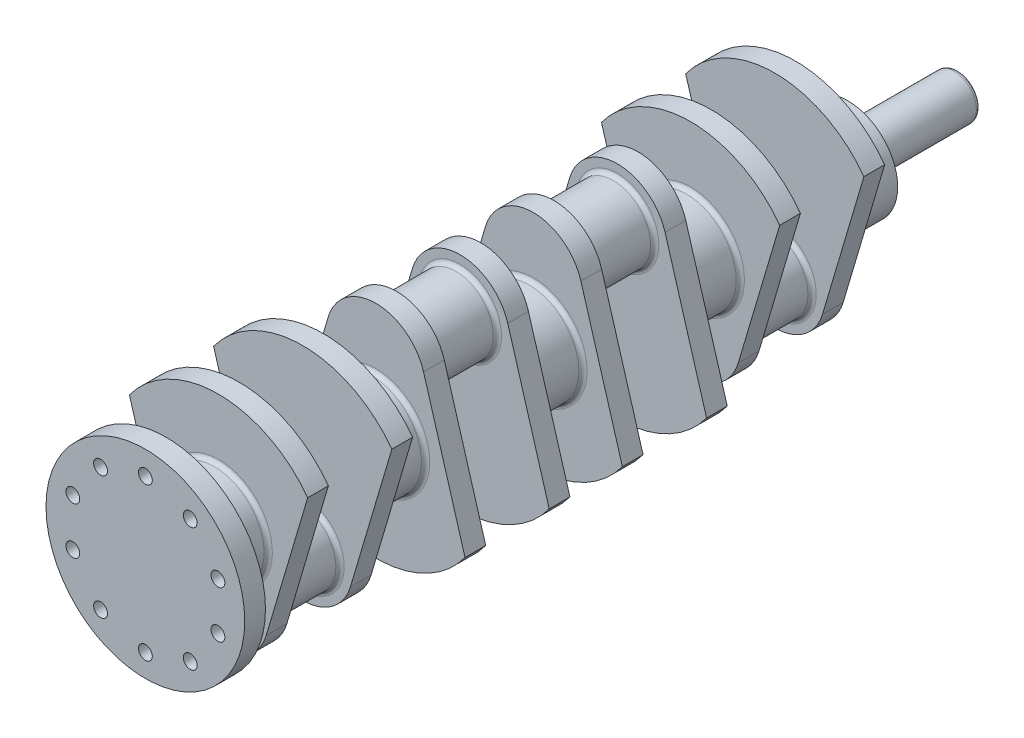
from build123d import *

# Parameters (mm, degrees)
BOSS_EXTRUDE1_DEPTH   = 15
SKETCH3_R             = 27
BOSS_EXTRUDE2_DEPTH   = 23
SKETCH4_R             = 36
BOSS_EXTRUDE3_DEPTH   = 38
FILLET1_R             = 3
BODY_MOVE_COPY2_ANGLE = 180
SKETCH5_R             = 16
BOSS_EXTRUDE4_DEPTH   = 80
FILLET2_R             = 3
SKETCH6_R             = 72
BOSS_EXTRUDE5_DEPTH   = 15
SKETCH8_R             = 5
CUT_EXTRUDE1_DEPTH    = 15
CIRPATTERN1_COUNT     = 10
FILLET3_R             = 3


with BuildPart() as part:
    # Sketch2 → Boss-Extrude1 (new body)
    with BuildSketch(Plane.XY):
        with BuildLine():
            ThreePointArc((64.569893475, 91.23059238), (0, 124), (-64.569893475, 91.23059238))
            Line((-64.569893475, 91.23059238), (-34.517510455, -10.224552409))
            ThreePointArc((-34.517510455, -10.224552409), (-5.165734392, 35.627449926), (36, 0))
            ThreePointArc((36, 0), (35.627449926, -5.165734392), (34.517510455, -10.224552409))
            Line((34.517510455, -10.224552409), (64.569893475, 91.23059238))
        make_face()
        with BuildLine():
            ThreePointArc((36, 0), (-5.165734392, 35.627449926), (-34.517510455, -10.224552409))
            ThreePointArc((-34.517510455, -10.224552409), (0, -36), (34.517510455, -10.224552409))
            ThreePointArc((34.517510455, -10.224552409), (35.627449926, -5.165734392), (36, 0))
        make_face()
    extrude(amount=BOSS_EXTRUDE1_DEPTH)

    # Sketch3 → Boss-Extrude2 (add)
    with BuildSketch(Plane.XY.offset(15)):
        Circle(SKETCH3_R)
    extrude(amount=BOSS_EXTRUDE2_DEPTH)

    # Sketch4 → Boss-Extrude3 (add)
    with BuildSketch(Plane(origin=(0, 0, 0), x_dir=(-1, 0, 0), z_dir=(0, 0, -1))):
        with Locations((0, 44)):
            Circle(SKETCH4_R)
    extrude(amount=BOSS_EXTRUDE3_DEPTH)

    # Fillet1
    fillet1_edges = [part.edges().sort_by_distance(p)[0] for p in [
        (-27, 0, 15),
        (36, 44, 0),
    ]]
    fillet(fillet1_edges, radius=FILLET1_R)

    # Mirror1: part across plane


with BuildPart() as part_1:
    add(part.part)
    add(part.part.mirror(Plane.XY.offset(38)))


with BuildPart() as body_2:
    # Mirror3: mirrored copy
    add(part_1.part.mirror(Plane.XY.offset(95)))


with BuildPart() as body_2_1:
    # Body-Move_Copy2: moved
    add(body_2.part.rotate(Axis((0, 44, 152), (1, 0, 0)), BODY_MOVE_COPY2_ANGLE))


with BuildPart() as body_3:
    # Mirror4: mirrored copy
    add(body_2_1.part.mirror(Plane.XY.offset(209)))


with BuildPart() as body_4:
    # Mirror4 2: mirrored copy
    add(part_1.part.mirror(Plane.XY.offset(209)))

    # Sketch6 → Boss-Extrude5 (add)
    with BuildSketch(Plane.XY.offset(456)):
        with Locations((0, 44)):
            Circle(SKETCH6_R)
    extrude(amount=BOSS_EXTRUDE5_DEPTH)

    # Sketch8 → Cut-Extrude1 (cut)
    with BuildSketch(Plane.XY.offset(471)):
        with Locations((0, 99)):
            Circle(SKETCH8_R)
    cut_extrude1 = extrude(amount=-CUT_EXTRUDE1_DEPTH, mode=Mode.SUBTRACT)

    # CirPattern1: Cut-Extrude1 ×10 about axis
    cirpattern1_axis = Axis((0, 43.73347548, 0), (0, 0, 1))
    for i in range(1, CIRPATTERN1_COUNT):
        add(cut_extrude1.rotate(cirpattern1_axis, i * 360 / CIRPATTERN1_COUNT), mode=Mode.SUBTRACT)


with BuildPart() as part_2:
    add(part_1.part)

    # Sketch5 → Boss-Extrude4 (add)
    with BuildSketch(Plane(origin=(0, 0, -38), x_dir=(-1, 0, 0), z_dir=(0, 0, -1))):
        with Locations((0, 44)):
            Circle(SKETCH5_R)
    extrude(amount=BOSS_EXTRUDE4_DEPTH)

    # Fillet2
    fillet2_edges = [part_2.edges().sort_by_distance(p)[0] for p in [
        (16, 44, -38),
    ]]
    fillet(fillet2_edges, radius=FILLET2_R)

    # Combine1: union body 2, body 3, body 4
    add(body_2_1.part)
    add(body_3.part)
    add(body_4.part)

    # Fillet3
    fillet3_edges = [part_2.edges().sort_by_distance(p)[0] for p in [
        (16, 44, -118),
        (36, 44, 456),
    ]]
    fillet(fillet3_edges, radius=FILLET3_R)


solid = part_2.part
